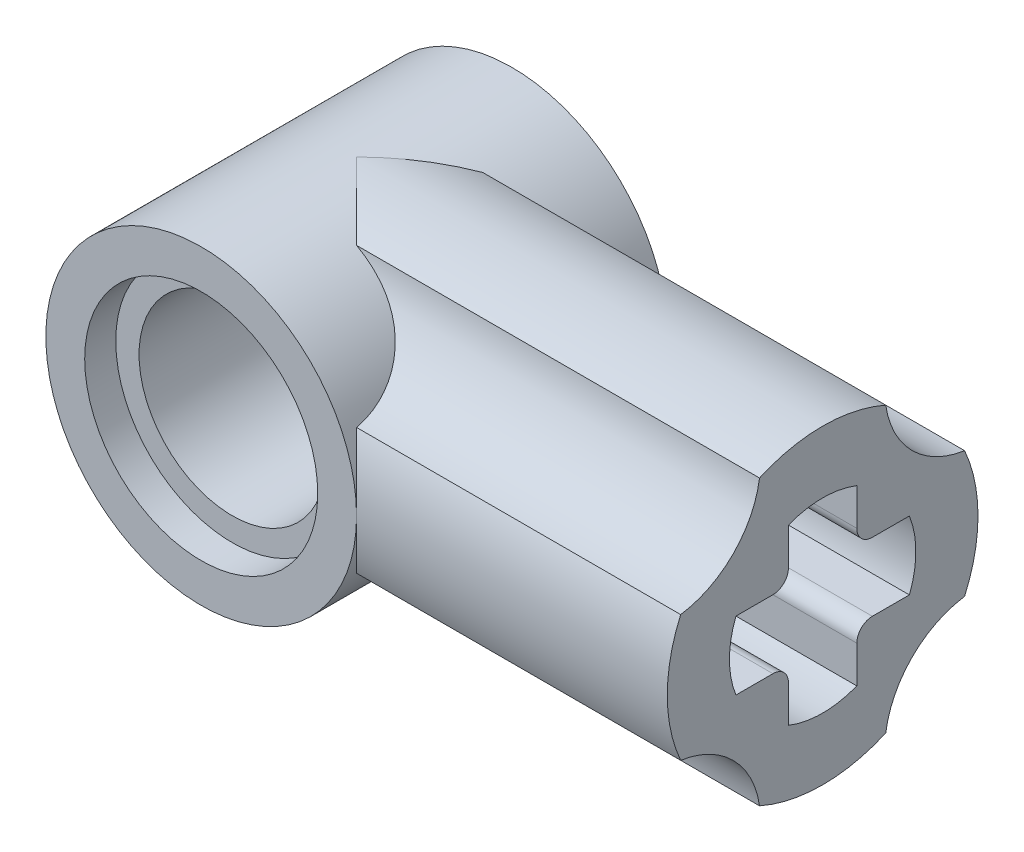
from build123d import *

# Parameters (mm, degrees)
BOSS_EXTRUDE1_DEPTH      = 4
BOSS_EXTRUDE1_DEPTH_BACK = 4
SKETCH1_R                = 4
SKETCH1_R_2              = 2.4
SKETCH2_R                = 3
CUT_EXTRUDE1_DEPTH       = 0.8
BOSS_EXTRUDE2_REACH      = 18.971
BOSS_EXTRUDE2_END_RADIUS = 4
FILLET1_R                = 0.4


with BuildPart() as part:
    # Sketch1 → Boss-Extrude1 (new, two sides: drawn at the far end of the back side and taken through both)
    with BuildSketch(Plane.XY.offset(-BOSS_EXTRUDE1_DEPTH_BACK)):
        with Locations((-12, 0)):
            Circle(SKETCH1_R)
        with Locations((-12, 0)):
            Circle(SKETCH1_R_2, mode=Mode.SUBTRACT)
    extrude(amount=BOSS_EXTRUDE1_DEPTH + BOSS_EXTRUDE1_DEPTH_BACK)

    # Sketch2 → Cut-Extrude1 (cut)
    with BuildSketch(Plane.XY.offset(4)):
        with Locations((-12, 0)):
            Circle(SKETCH2_R)
    cut_extrude1 = extrude(amount=-CUT_EXTRUDE1_DEPTH, mode=Mode.SUBTRACT)

    # Mirror1: Cut-Extrude1 across plane
    add(cut_extrude1.mirror(Plane.XY), mode=Mode.SUBTRACT)

    # Boss-Extrude2: up to this cylinder (the profile starts outside it)
    boss_extrude2_end = Plane(origin=(-12, 0, 0), z_dir=(0, 0, 1)) * Cylinder(BOSS_EXTRUDE2_END_RADIUS, 46.942, mode=Mode.PRIVATE)
    # Sketch3 → Boss-Extrude2 (add, up to the surface)
    with BuildSketch(Plane(origin=(0, 0, 0), x_dir=(0, 0, -1), z_dir=(1, 0, 0)), mode=Mode.PRIVATE) as boss_extrude2_sk1:
        with BuildLine():
            ThreePointArc((-1.624913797, -3.655086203), (0, -4), (1.624913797, -3.655086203))
            ThreePointArc((1.624913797, -3.655086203), (2.302943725, -2.302943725), (3.655086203, -1.624913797))
            ThreePointArc((3.655086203, -1.624913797), (4, 0), (3.655086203, 1.624913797))
            ThreePointArc((3.655086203, 1.624913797), (2.302943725, 2.302943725), (1.624913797, 3.655086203))
            ThreePointArc((1.624913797, 3.655086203), (0, 4), (-1.624913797, 3.655086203))
            ThreePointArc((-1.624913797, 3.655086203), (-2.302943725, 2.302943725), (-3.655086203, 1.624913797))
            ThreePointArc((-3.655086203, 1.624913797), (-4, 0), (-3.655086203, -1.624913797))
            ThreePointArc((-3.655086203, -1.624913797), (-2.302943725, -2.302943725), (-1.624913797, -3.655086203))
        make_face()
        with BuildLine():
            Line((-0.88, 2.232845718), (-0.88, 0.88))
            Line((-0.88, 0.88), (-2.232845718, 0.88))
            ThreePointArc((-2.232845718, 0.88), (-2.4, 0), (-2.232845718, -0.88))
            Line((-2.232845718, -0.88), (-0.88, -0.88))
            Line((-0.88, -0.88), (-0.88, -2.232845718))
            ThreePointArc((-0.88, -2.232845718), (0, -2.4), (0.88, -2.232845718))
            Line((0.88, -2.232845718), (0.88, -0.88))
            Line((0.88, -0.88), (2.232845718, -0.88))
            ThreePointArc((2.232845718, -0.88), (2.4, 0), (2.232845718, 0.88))
            Line((2.232845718, 0.88), (0.88, 0.88))
            Line((0.88, 0.88), (0.88, 2.232845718))
            ThreePointArc((0.88, 2.232845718), (0, 2.4), (-0.88, 2.232845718))
        make_face(mode=Mode.SUBTRACT)
    boss_extrude2_tool1 = extrude(boss_extrude2_sk1.sketch, amount=-BOSS_EXTRUDE2_REACH, mode=Mode.PRIVATE) - boss_extrude2_end
    add(boss_extrude2_tool1.solids().sort_by_distance((0, -3.886863, 0))[0])

    # Fillet1
    fillet1_edges = [part.edges().sort_by_distance(p)[0] for p in [
        (-4.049000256, 0.88, -0.88),
        (-4.049000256, -0.88, -0.88),
        (-4.049000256, -0.88, 0.88),
        (-4.049000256, 0.88, 0.88),
    ]]
    fillet(fillet1_edges, radius=FILLET1_R)


solid = part.part
